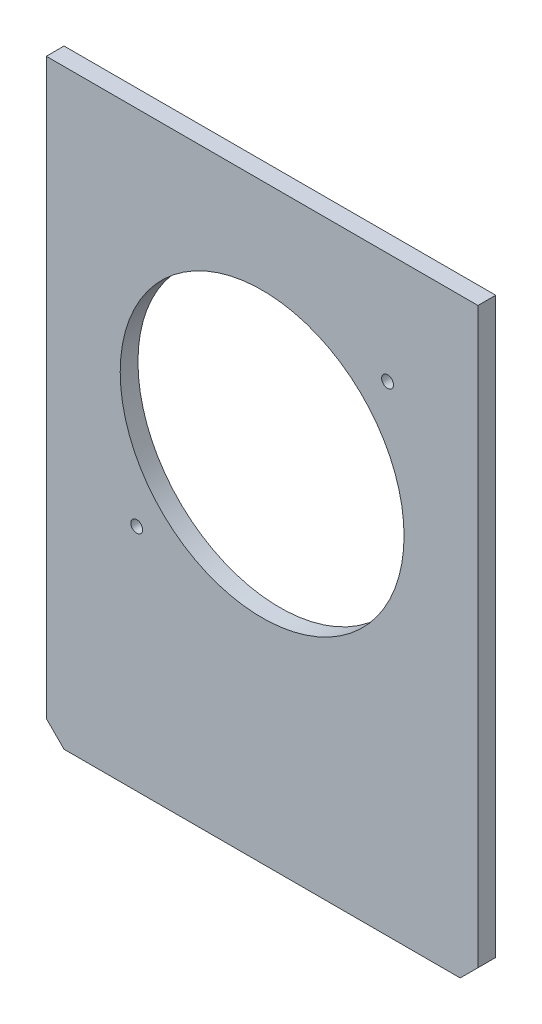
ISO-10303-21;
HEADER;
FILE_DESCRIPTION(('STEP AP214'),'2;1');
FILE_NAME('part.step','',(''),(''),'','','');
FILE_SCHEMA(('AUTOMOTIVE_DESIGN { 1 0 10303 214 1 1 1 1 }'));
ENDSEC;
DATA;
#1=APPLICATION_CONTEXT('core data for automotive mechanical design processes');
#2=APPLICATION_PROTOCOL_DEFINITION('international standard','automotive_design',2000,#1);
#3=PRODUCT_CONTEXT('',#1,'mechanical');
#4=PRODUCT('Part','Part','',(#3));
#5=PRODUCT_RELATED_PRODUCT_CATEGORY('part','',(#4));
#6=PRODUCT_DEFINITION_FORMATION('','',#4);
#7=PRODUCT_DEFINITION_CONTEXT('part definition',#1,'design');
#8=PRODUCT_DEFINITION('design','',#6,#7);
#9=PRODUCT_DEFINITION_SHAPE('','',#8);
#10=(LENGTH_UNIT() NAMED_UNIT(*) SI_UNIT(.MILLI.,.METRE.));
#11=(NAMED_UNIT(*) PLANE_ANGLE_UNIT() SI_UNIT($,.RADIAN.));
#12=(NAMED_UNIT(*) SI_UNIT($,.STERADIAN.) SOLID_ANGLE_UNIT());
#13=UNCERTAINTY_MEASURE_WITH_UNIT(LENGTH_MEASURE(1.E-05),#10,'distance_accuracy_value','');
#14=(GEOMETRIC_REPRESENTATION_CONTEXT(3) GLOBAL_UNCERTAINTY_ASSIGNED_CONTEXT((#13)) GLOBAL_UNIT_ASSIGNED_CONTEXT((#10,
#11,#12)) REPRESENTATION_CONTEXT('',''));
#15=CARTESIAN_POINT('',(0.,0.,0.));
#16=DIRECTION('',(0.,0.,1.));
#17=DIRECTION('',(1.,0.,0.));
#18=AXIS2_PLACEMENT_3D('',#15,#16,#17);
#19=CARTESIAN_POINT('',(-17.0361286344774,-70.3957105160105,3.));
#20=DIRECTION('',(0.,0.,1.));
#21=DIRECTION('',(1.,0.,0.));
#22=AXIS2_PLACEMENT_3D('',#19,#20,#21);
#23=PLANE('',#22);
#24=CARTESIAN_POINT('',(40.677074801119,10.8174929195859,3.));
#25=DIRECTION('',(0.,0.,1.));
#26=DIRECTION('',(1.,0.,0.));
#27=AXIS2_PLACEMENT_3D('',#24,#25,#26);
#28=CIRCLE('',#27,0.999999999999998);
#29=CARTESIAN_POINT('',(41.677074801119,10.8174929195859,3.));
#30=VERTEX_POINT('',#29);
#31=EDGE_CURVE('E148',#30,#30,#28,.T.);
#32=ORIENTED_EDGE('',*,*,#31,.F.);
#33=EDGE_LOOP('',(#32));
#34=FACE_BOUND('',#33,.T.);
#35=DIRECTION('',(0.,-1.,0.));
#36=VECTOR('',#35,1.);
#37=CARTESIAN_POINT('',(-17.0361286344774,29.6042894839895,3.));
#38=LINE('',#37,#36);
#39=CARTESIAN_POINT('',(-17.0361286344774,29.6042894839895,3.));
#40=VERTEX_POINT('',#39);
#41=CARTESIAN_POINT('',(-17.0361286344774,-67.3957105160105,3.));
#42=VERTEX_POINT('',#41);
#43=EDGE_CURVE('E118',#40,#42,#38,.T.);
#44=ORIENTED_EDGE('',*,*,#43,.T.);
#45=DIRECTION('',(-0.707106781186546,0.707106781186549,0.));
#46=VECTOR('',#45,1.);
#47=CARTESIAN_POINT('',(-15.5361286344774,-68.8957105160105,3.));
#48=LINE('',#47,#46);
#49=CARTESIAN_POINT('',(-14.0361286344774,-70.3957105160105,3.));
#50=VERTEX_POINT('',#49);
#51=EDGE_CURVE('E39',#42,#50,#48,.F.);
#52=ORIENTED_EDGE('',*,*,#51,.T.);
#53=DIRECTION('',(1.,0.,0.));
#54=VECTOR('',#53,1.);
#55=CARTESIAN_POINT('',(-17.0361286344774,-70.3957105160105,3.));
#56=LINE('',#55,#54);
#57=CARTESIAN_POINT('',(52.9638713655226,-70.3957105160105,3.));
#58=VERTEX_POINT('',#57);
#59=EDGE_CURVE('E92',#50,#58,#56,.T.);
#60=ORIENTED_EDGE('',*,*,#59,.T.);
#61=DIRECTION('',(-0.707106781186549,-0.707106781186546,0.));
#62=VECTOR('',#61,1.);
#63=CARTESIAN_POINT('',(17.9638713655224,-105.39571051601,3.));
#64=LINE('',#63,#62);
#65=CARTESIAN_POINT('',(55.9638713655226,-67.3957105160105,3.));
#66=VERTEX_POINT('',#65);
#67=EDGE_CURVE('E46',#58,#66,#64,.F.);
#68=ORIENTED_EDGE('',*,*,#67,.T.);
#69=DIRECTION('',(0.,1.,0.));
#70=VECTOR('',#69,1.);
#71=CARTESIAN_POINT('',(55.9638713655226,29.6042894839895,3.));
#72=LINE('',#71,#70);
#73=CARTESIAN_POINT('',(55.9638713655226,29.6042894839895,3.));
#74=VERTEX_POINT('',#73);
#75=EDGE_CURVE('E84',#66,#74,#72,.T.);
#76=ORIENTED_EDGE('',*,*,#75,.T.);
#77=DIRECTION('',(-1.,0.,0.));
#78=VECTOR('',#77,1.);
#79=CARTESIAN_POINT('',(-17.0361286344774,29.6042894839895,3.));
#80=LINE('',#79,#78);
#81=EDGE_CURVE('E88',#74,#40,#80,.T.);
#82=ORIENTED_EDGE('',*,*,#81,.T.);
#83=EDGE_LOOP('',(#44,#52,#60,#68,#76,#82));
#84=FACE_BOUND('',#83,.T.);
#85=CARTESIAN_POINT('',(19.4638713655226,-10.3957105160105,3.));
#86=DIRECTION('',(0.,0.,1.));
#87=DIRECTION('',(1.,0.,0.));
#88=AXIS2_PLACEMENT_3D('',#85,#86,#87);
#89=CIRCLE('',#88,24.);
#90=CARTESIAN_POINT('',(43.4638713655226,-10.3957105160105,3.));
#91=VERTEX_POINT('',#90);
#92=EDGE_CURVE('E113',#91,#91,#89,.T.);
#93=ORIENTED_EDGE('',*,*,#92,.F.);
#94=EDGE_LOOP('',(#93));
#95=FACE_BOUND('',#94,.T.);
#96=CARTESIAN_POINT('',(-1.74933207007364,-31.6089139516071,3.));
#97=DIRECTION('',(0.,0.,1.));
#98=DIRECTION('',(1.,0.,0.));
#99=AXIS2_PLACEMENT_3D('',#96,#97,#98);
#100=CIRCLE('',#99,1.);
#101=CARTESIAN_POINT('',(-0.74933207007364,-31.6089139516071,3.));
#102=VERTEX_POINT('',#101);
#103=EDGE_CURVE('E154',#102,#102,#100,.T.);
#104=ORIENTED_EDGE('',*,*,#103,.F.);
#105=EDGE_LOOP('',(#104));
#106=FACE_BOUND('',#105,.T.);
#107=ADVANCED_FACE('F31',(#34,#84,#95,#106),#23,.T.);
#108=CARTESIAN_POINT('',(-17.0361286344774,-70.3957105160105,0.));
#109=DIRECTION('',(0.,0.,1.));
#110=DIRECTION('',(1.,0.,0.));
#111=AXIS2_PLACEMENT_3D('',#108,#109,#110);
#112=PLANE('',#111);
#113=CARTESIAN_POINT('',(40.677074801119,10.8174929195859,0.));
#114=DIRECTION('',(0.,0.,1.));
#115=DIRECTION('',(1.,0.,0.));
#116=AXIS2_PLACEMENT_3D('',#113,#114,#115);
#117=CIRCLE('',#116,0.999999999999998);
#118=CARTESIAN_POINT('',(41.677074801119,10.8174929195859,0.));
#119=VERTEX_POINT('',#118);
#120=EDGE_CURVE('E151',#119,#119,#117,.T.);
#121=ORIENTED_EDGE('',*,*,#120,.T.);
#122=EDGE_LOOP('',(#121));
#123=FACE_BOUND('',#122,.T.);
#124=DIRECTION('',(1.,0.,0.));
#125=VECTOR('',#124,1.);
#126=CARTESIAN_POINT('',(-17.0361286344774,-70.3957105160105,0.));
#127=LINE('',#126,#125);
#128=CARTESIAN_POINT('',(-14.0361286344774,-70.3957105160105,0.));
#129=VERTEX_POINT('',#128);
#130=CARTESIAN_POINT('',(52.9638713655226,-70.3957105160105,0.));
#131=VERTEX_POINT('',#130);
#132=EDGE_CURVE('E112',#129,#131,#127,.T.);
#133=ORIENTED_EDGE('',*,*,#132,.F.);
#134=DIRECTION('',(0.707106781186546,-0.707106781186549,0.));
#135=VECTOR('',#134,1.);
#136=CARTESIAN_POINT('',(-14.0361286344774,-70.3957105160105,0.));
#137=LINE('',#136,#135);
#138=CARTESIAN_POINT('',(-17.0361286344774,-67.3957105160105,0.));
#139=VERTEX_POINT('',#138);
#140=EDGE_CURVE('E126',#129,#139,#137,.F.);
#141=ORIENTED_EDGE('',*,*,#140,.T.);
#142=DIRECTION('',(0.,-1.,0.));
#143=VECTOR('',#142,1.);
#144=CARTESIAN_POINT('',(-17.0361286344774,29.6042894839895,0.));
#145=LINE('',#144,#143);
#146=CARTESIAN_POINT('',(-17.0361286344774,29.6042894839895,0.));
#147=VERTEX_POINT('',#146);
#148=EDGE_CURVE('E110',#147,#139,#145,.T.);
#149=ORIENTED_EDGE('',*,*,#148,.F.);
#150=DIRECTION('',(-1.,0.,0.));
#151=VECTOR('',#150,1.);
#152=CARTESIAN_POINT('',(-17.0361286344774,29.6042894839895,0.));
#153=LINE('',#152,#151);
#154=CARTESIAN_POINT('',(55.9638713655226,29.6042894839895,0.));
#155=VERTEX_POINT('',#154);
#156=EDGE_CURVE('E117',#155,#147,#153,.T.);
#157=ORIENTED_EDGE('',*,*,#156,.F.);
#158=DIRECTION('',(0.,1.,0.));
#159=VECTOR('',#158,1.);
#160=CARTESIAN_POINT('',(55.9638713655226,29.6042894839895,0.));
#161=LINE('',#160,#159);
#162=CARTESIAN_POINT('',(55.9638713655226,-67.3957105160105,0.));
#163=VERTEX_POINT('',#162);
#164=EDGE_CURVE('E98',#163,#155,#161,.T.);
#165=ORIENTED_EDGE('',*,*,#164,.F.);
#166=DIRECTION('',(0.707106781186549,0.707106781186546,0.));
#167=VECTOR('',#166,1.);
#168=CARTESIAN_POINT('',(55.9638713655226,-67.3957105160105,0.));
#169=LINE('',#168,#167);
#170=EDGE_CURVE('E124',#163,#131,#169,.F.);
#171=ORIENTED_EDGE('',*,*,#170,.T.);
#172=EDGE_LOOP('',(#133,#141,#149,#157,#165,#171));
#173=FACE_BOUND('',#172,.T.);
#174=CARTESIAN_POINT('',(19.4638713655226,-10.3957105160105,0.));
#175=DIRECTION('',(0.,0.,1.));
#176=DIRECTION('',(1.,0.,0.));
#177=AXIS2_PLACEMENT_3D('',#174,#175,#176);
#178=CIRCLE('',#177,24.);
#179=CARTESIAN_POINT('',(43.4638713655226,-10.3957105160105,0.));
#180=VERTEX_POINT('',#179);
#181=EDGE_CURVE('E145',#180,#180,#178,.T.);
#182=ORIENTED_EDGE('',*,*,#181,.T.);
#183=EDGE_LOOP('',(#182));
#184=FACE_BOUND('',#183,.T.);
#185=CARTESIAN_POINT('',(-1.74933207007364,-31.6089139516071,0.));
#186=DIRECTION('',(0.,0.,1.));
#187=DIRECTION('',(1.,0.,0.));
#188=AXIS2_PLACEMENT_3D('',#185,#186,#187);
#189=CIRCLE('',#188,1.);
#190=CARTESIAN_POINT('',(-0.74933207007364,-31.6089139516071,0.));
#191=VERTEX_POINT('',#190);
#192=EDGE_CURVE('E157',#191,#191,#189,.T.);
#193=ORIENTED_EDGE('',*,*,#192,.T.);
#194=EDGE_LOOP('',(#193));
#195=FACE_BOUND('',#194,.T.);
#196=ADVANCED_FACE('F140',(#123,#173,#184,#195),#112,.F.);
#197=CARTESIAN_POINT('',(-17.0361286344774,29.6042894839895,3.));
#198=DIRECTION('',(1.,0.,0.));
#199=DIRECTION('',(0.,1.,0.));
#200=AXIS2_PLACEMENT_3D('',#197,#198,#199);
#201=PLANE('',#200);
#202=ORIENTED_EDGE('',*,*,#148,.T.);
#203=DIRECTION('',(0.,0.,1.));
#204=VECTOR('',#203,1.);
#205=CARTESIAN_POINT('',(-17.0361286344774,-67.3957105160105,3.));
#206=LINE('',#205,#204);
#207=EDGE_CURVE('E54',#139,#42,#206,.T.);
#208=ORIENTED_EDGE('',*,*,#207,.T.);
#209=ORIENTED_EDGE('',*,*,#43,.F.);
#210=DIRECTION('',(0.,0.,-1.));
#211=VECTOR('',#210,1.);
#212=CARTESIAN_POINT('',(-17.0361286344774,29.6042894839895,3.));
#213=LINE('',#212,#211);
#214=EDGE_CURVE('E102',#40,#147,#213,.T.);
#215=ORIENTED_EDGE('',*,*,#214,.T.);
#216=EDGE_LOOP('',(#202,#208,#209,#215));
#217=FACE_BOUND('',#216,.T.);
#218=ADVANCED_FACE('F142',(#217),#201,.F.);
#219=CARTESIAN_POINT('',(-17.0361286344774,-70.3957105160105,3.));
#220=DIRECTION('',(0.,1.,0.));
#221=DIRECTION('',(0.,0.,1.));
#222=AXIS2_PLACEMENT_3D('',#219,#220,#221);
#223=PLANE('',#222);
#224=ORIENTED_EDGE('',*,*,#59,.F.);
#225=DIRECTION('',(0.,0.,-1.));
#226=VECTOR('',#225,1.);
#227=CARTESIAN_POINT('',(-14.0361286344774,-70.3957105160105,3.));
#228=LINE('',#227,#226);
#229=EDGE_CURVE('E121',#50,#129,#228,.T.);
#230=ORIENTED_EDGE('',*,*,#229,.T.);
#231=ORIENTED_EDGE('',*,*,#132,.T.);
#232=DIRECTION('',(0.,0.,1.));
#233=VECTOR('',#232,1.);
#234=CARTESIAN_POINT('',(52.9638713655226,-70.3957105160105,3.));
#235=LINE('',#234,#233);
#236=EDGE_CURVE('E101',#131,#58,#235,.T.);
#237=ORIENTED_EDGE('',*,*,#236,.T.);
#238=EDGE_LOOP('',(#224,#230,#231,#237));
#239=FACE_BOUND('',#238,.T.);
#240=ADVANCED_FACE('F134',(#239),#223,.F.);
#241=CARTESIAN_POINT('',(55.9638713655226,29.6042894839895,3.));
#242=DIRECTION('',(-1.,0.,0.));
#243=DIRECTION('',(0.,-1.,0.));
#244=AXIS2_PLACEMENT_3D('',#241,#242,#243);
#245=PLANE('',#244);
#246=ORIENTED_EDGE('',*,*,#75,.F.);
#247=DIRECTION('',(0.,0.,-1.));
#248=VECTOR('',#247,1.);
#249=CARTESIAN_POINT('',(55.9638713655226,-67.3957105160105,3.));
#250=LINE('',#249,#248);
#251=EDGE_CURVE('E11',#66,#163,#250,.T.);
#252=ORIENTED_EDGE('',*,*,#251,.T.);
#253=ORIENTED_EDGE('',*,*,#164,.T.);
#254=DIRECTION('',(0.,0.,-1.));
#255=VECTOR('',#254,1.);
#256=CARTESIAN_POINT('',(55.9638713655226,29.6042894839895,3.));
#257=LINE('',#256,#255);
#258=EDGE_CURVE('E95',#74,#155,#257,.T.);
#259=ORIENTED_EDGE('',*,*,#258,.F.);
#260=EDGE_LOOP('',(#246,#252,#253,#259));
#261=FACE_BOUND('',#260,.T.);
#262=ADVANCED_FACE('F96',(#261),#245,.F.);
#263=CARTESIAN_POINT('',(-17.0361286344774,29.6042894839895,3.));
#264=DIRECTION('',(0.,-1.,0.));
#265=DIRECTION('',(0.,0.,-1.));
#266=AXIS2_PLACEMENT_3D('',#263,#264,#265);
#267=PLANE('',#266);
#268=ORIENTED_EDGE('',*,*,#156,.T.);
#269=ORIENTED_EDGE('',*,*,#214,.F.);
#270=ORIENTED_EDGE('',*,*,#81,.F.);
#271=ORIENTED_EDGE('',*,*,#258,.T.);
#272=EDGE_LOOP('',(#268,#269,#270,#271));
#273=FACE_BOUND('',#272,.T.);
#274=ADVANCED_FACE('F104',(#273),#267,.F.);
#275=CARTESIAN_POINT('',(19.4638713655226,-10.3957105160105,3.));
#276=DIRECTION('',(0.,0.,-1.));
#277=DIRECTION('',(-1.,0.,0.));
#278=AXIS2_PLACEMENT_3D('',#275,#276,#277);
#279=CYLINDRICAL_SURFACE('',#278,24.);
#280=ORIENTED_EDGE('',*,*,#92,.T.);
#281=EDGE_LOOP('',(#280));
#282=FACE_BOUND('',#281,.T.);
#283=ORIENTED_EDGE('',*,*,#181,.F.);
#284=EDGE_LOOP('',(#283));
#285=FACE_BOUND('',#284,.T.);
#286=ADVANCED_FACE('F176',(#282,#285),#279,.F.);
#287=CARTESIAN_POINT('',(40.677074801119,10.8174929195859,3.));
#288=DIRECTION('',(0.,0.,-1.));
#289=DIRECTION('',(-1.,0.,0.));
#290=AXIS2_PLACEMENT_3D('',#287,#288,#289);
#291=CYLINDRICAL_SURFACE('',#290,0.999999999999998);
#292=ORIENTED_EDGE('',*,*,#31,.T.);
#293=EDGE_LOOP('',(#292));
#294=FACE_BOUND('',#293,.T.);
#295=ORIENTED_EDGE('',*,*,#120,.F.);
#296=EDGE_LOOP('',(#295));
#297=FACE_BOUND('',#296,.T.);
#298=ADVANCED_FACE('F192',(#294,#297),#291,.F.);
#299=CARTESIAN_POINT('',(-1.74933207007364,-31.6089139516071,3.));
#300=DIRECTION('',(0.,0.,-1.));
#301=DIRECTION('',(-1.,0.,0.));
#302=AXIS2_PLACEMENT_3D('',#299,#300,#301);
#303=CYLINDRICAL_SURFACE('',#302,1.);
#304=ORIENTED_EDGE('',*,*,#103,.T.);
#305=EDGE_LOOP('',(#304));
#306=FACE_BOUND('',#305,.T.);
#307=ORIENTED_EDGE('',*,*,#192,.F.);
#308=EDGE_LOOP('',(#307));
#309=FACE_BOUND('',#308,.T.);
#310=ADVANCED_FACE('F163',(#306,#309),#303,.F.);
#311=CARTESIAN_POINT('',(-14.0361286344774,-70.3957105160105,3.));
#312=DIRECTION('',(0.707106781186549,0.707106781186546,0.));
#313=DIRECTION('',(-0.707106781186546,0.707106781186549,0.));
#314=AXIS2_PLACEMENT_3D('',#311,#312,#313);
#315=PLANE('',#314);
#316=ORIENTED_EDGE('',*,*,#51,.F.);
#317=ORIENTED_EDGE('',*,*,#207,.F.);
#318=ORIENTED_EDGE('',*,*,#140,.F.);
#319=ORIENTED_EDGE('',*,*,#229,.F.);
#320=EDGE_LOOP('',(#316,#317,#318,#319));
#321=FACE_BOUND('',#320,.T.);
#322=ADVANCED_FACE('F137',(#321),#315,.F.);
#323=CARTESIAN_POINT('',(55.9638713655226,-67.3957105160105,3.));
#324=DIRECTION('',(-0.707106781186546,0.707106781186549,0.));
#325=DIRECTION('',(-0.707106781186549,-0.707106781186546,0.));
#326=AXIS2_PLACEMENT_3D('',#323,#324,#325);
#327=PLANE('',#326);
#328=ORIENTED_EDGE('',*,*,#67,.F.);
#329=ORIENTED_EDGE('',*,*,#236,.F.);
#330=ORIENTED_EDGE('',*,*,#170,.F.);
#331=ORIENTED_EDGE('',*,*,#251,.F.);
#332=EDGE_LOOP('',(#328,#329,#330,#331));
#333=FACE_BOUND('',#332,.T.);
#334=ADVANCED_FACE('F33',(#333),#327,.F.);
#335=CLOSED_SHELL('',(#107,#196,#218,#240,#262,#274,#286,#298,#310,#322,#334));
#336=MANIFOLD_SOLID_BREP('B2',#335);
#337=ADVANCED_BREP_SHAPE_REPRESENTATION('',(#18,#336),#14);
#338=SHAPE_DEFINITION_REPRESENTATION(#9,#337);
ENDSEC;
END-ISO-10303-21;
